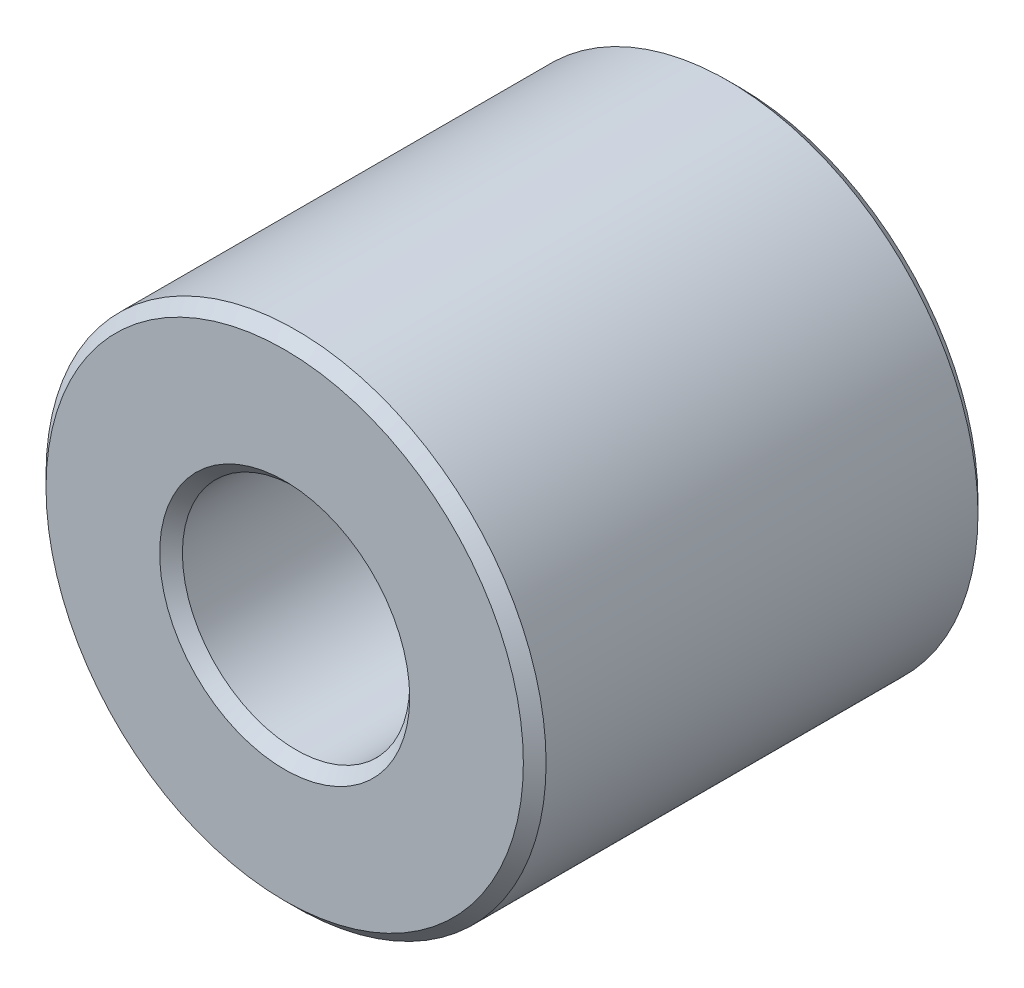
from build123d import *

# Parameters (mm, degrees)
SKETCH1_R           = 11
SKETCH1_R_2         = 5
BOSS_EXTRUDE1_DEPTH = 10
CHAMFER1_SIZE       = 0.5


with BuildPart() as part:
    # Sketch1 → Boss-Extrude1 (new, symmetric)
    with BuildSketch(Plane.XY):
        Circle(SKETCH1_R)
        Circle(SKETCH1_R_2, mode=Mode.SUBTRACT)
    extrude(amount=BOSS_EXTRUDE1_DEPTH, both=True)

    # Chamfer1
    chamfer1_edges = [part.edges().sort_by_distance(p)[0] for p in [
        (-11, 0, -10),
        (-11, 0, 10),
        (-5, 0, -10),
        (-5, 0, 10),
    ]]
    chamfer(chamfer1_edges, length=CHAMFER1_SIZE)


solid = part.part
